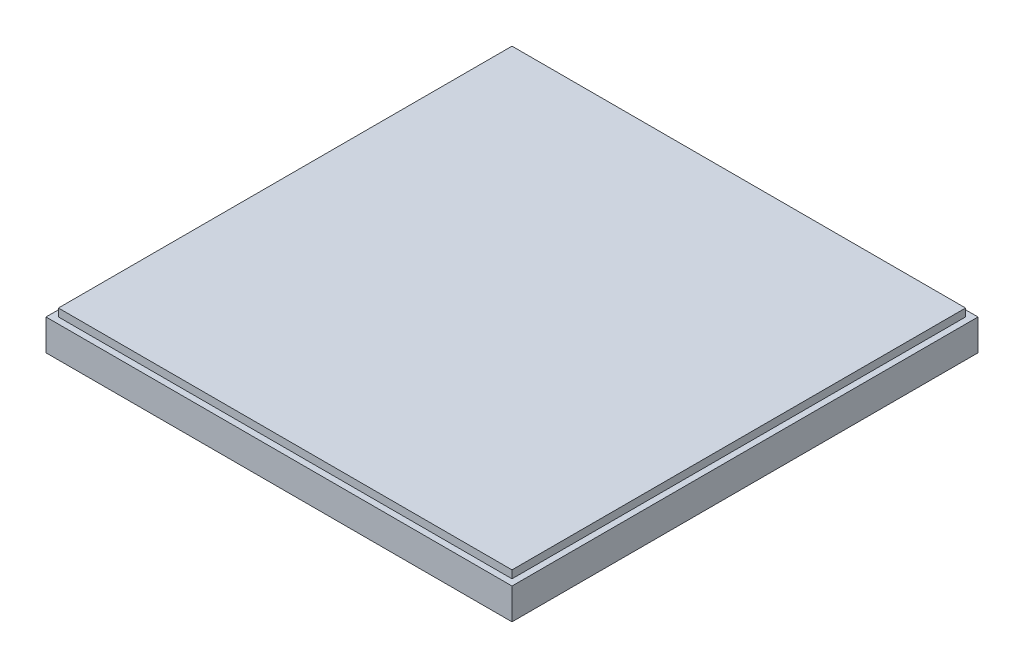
from build123d import *

# Parameters (mm, degrees)
SKETCH_1_W             = 60
SKETCH_1_H             = 60
EXTRUDE_1_DEPTH        = 4
SKETCH_2_W             = 58
SKETCH_2_H             = 58
CUT_EXTRUDE_1_DEPTH    = 2
SKETCH_4_W             = 50
SKETCH_4_H             = 49.5
EXTRUDE_2_DEPTH        = 0.2
CHAMFER_1_SIZE         = 1
SKETCH_6_W             = 1
SKETCH_6_H             = 49.5
EXTRUDE_3_DEPTH        = 0.1
SKETCH_8_W             = 49
SKETCH_8_H             = 0.2
EXTRUDE_4_DEPTH        = 0.1
PATTERN_LINEAR_1_COUNT = 22
PATTERN_LINEAR_1_PITCH = 2.2
SKETCH_9_W             = 1
SKETCH_9_H             = 6.5
EXTRUDE_5_DEPTH        = 0.4
SKETCH_10_W            = 1
SKETCH_10_H            = 6.5
EXTRUDE_6_DEPTH        = 0.1
SKETCH_11_W            = 58.4
SKETCH_11_H            = 58.4
EXTRUDE_7_DEPTH        = 1


with BuildPart() as part:
    # Sketch 1 → Extrude 1 (new body)
    with BuildSketch(Plane(origin=(0, 0, 0), x_dir=(1, 0, 0), z_dir=(0, 1, 0))):
        Rectangle(SKETCH_1_W, SKETCH_1_H)
    extrude(amount=EXTRUDE_1_DEPTH)

    # Sketch 2 → Cut-Extrude 1 (cut)
    with BuildSketch(Plane(origin=(0, 4, 0), x_dir=(1, 0, 0), z_dir=(0, 1, 0))):
        Rectangle(SKETCH_2_W, SKETCH_2_H)
    extrude(amount=-CUT_EXTRUDE_1_DEPTH, mode=Mode.SUBTRACT)

    # Sketch 4 → Extrude 2 (add)
    with BuildSketch(Plane(origin=(0, 2, 0), x_dir=(1, 0, 0), z_dir=(0, 1, 0))):
        with Locations((0, 2.25)):
            Rectangle(SKETCH_4_W, SKETCH_4_H)
    extrude(amount=EXTRUDE_2_DEPTH)

    # Chamfer 1
    chamfer_1_edges = [part.edges().sort_by_distance(p)[0] for p in [
        (25, 2.1, 22.5),
    ]]
    chamfer(chamfer_1_edges, length=CHAMFER_1_SIZE)

    # Sketch 6 → Extrude 3 (add)
    with BuildSketch(Plane(origin=(0, 2.2, 0), x_dir=(1, 0, 0), z_dir=(0, 1, 0))):
        with Locations((0, 2.25)):
            Rectangle(SKETCH_6_W, SKETCH_6_H)
    extrude(amount=EXTRUDE_3_DEPTH)

    # Sketch 8 → Extrude 4 (add)
    with BuildSketch(Plane(origin=(0, 2.2, 0), x_dir=(1, 0, 0), z_dir=(0, 1, 0))):
        with Locations((-0.5, 24.7)):
            Rectangle(SKETCH_8_W, SKETCH_8_H)
    extrude_4 = extrude(amount=EXTRUDE_4_DEPTH)

    # Pattern Linear 1: Extrude 4 ×22
    with Locations(*[(0, 0, i * PATTERN_LINEAR_1_PITCH) for i in range(1, PATTERN_LINEAR_1_COUNT)]):
        add(extrude_4)

    # Sketch 9 → Extrude 5 (add)
    with BuildSketch(Plane(origin=(0, 2, 0), x_dir=(1, 0, 0), z_dir=(0, 1, 0))):
        with Locations((0, -25.75)):
            Rectangle(SKETCH_9_W, SKETCH_9_H)
    extrude(amount=EXTRUDE_5_DEPTH)

    # Sketch 10 → Extrude 6 (add)
    with BuildSketch(Plane(origin=(0, 2, 0), x_dir=(1, 0, 0), z_dir=(0, 1, 0))):
        with Locations((-2, -25.75)):
            Rectangle(SKETCH_10_W, SKETCH_10_H)
    extrude(amount=EXTRUDE_6_DEPTH)

    # Sketch 11 → Extrude 7 (add)
    with BuildSketch(Plane(origin=(0, 4, 0), x_dir=(1, 0, 0), z_dir=(0, 1, 0))):
        Rectangle(SKETCH_11_W, SKETCH_11_H)
    extrude(amount=EXTRUDE_7_DEPTH)


solid = part.part
